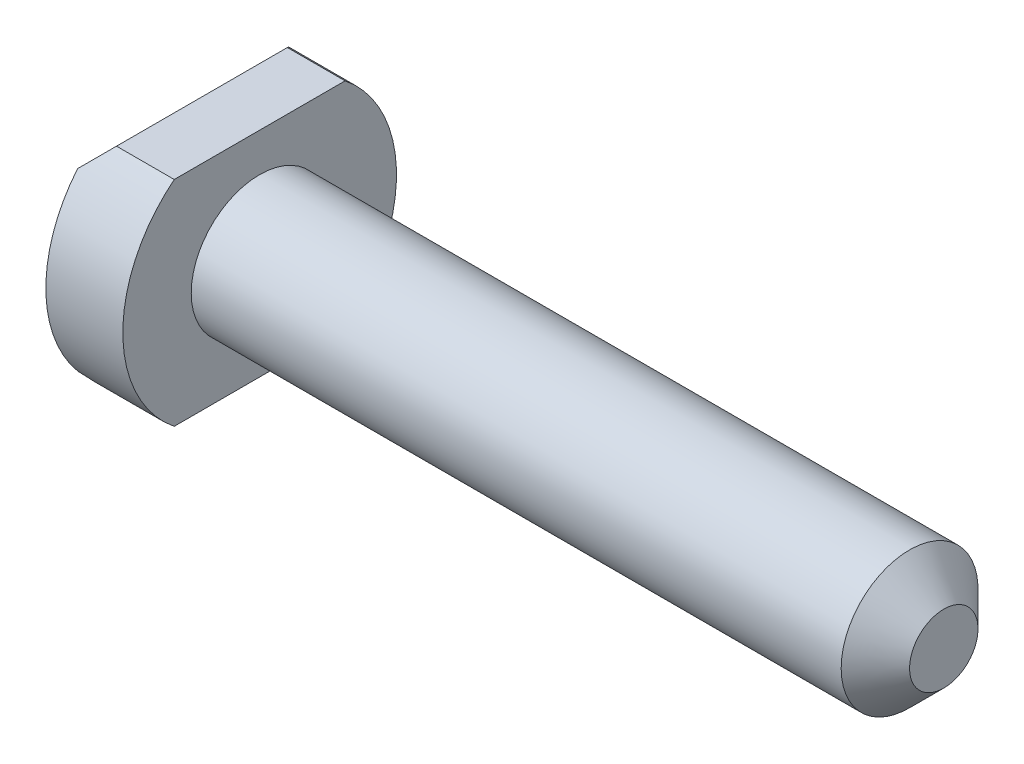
from build123d import *

# Parameters (mm, degrees)
BASEHEAD_DEPTH   = 9
HEADCHAMFER_SIZE = 2.25
BOLTSKE_W        = 20
BOLTSKE_H        = 8


with BuildPart() as part:
    # BaseHeadSke → BaseHead (new body)
    with BuildSketch(Plane(origin=(0, 0, 0), x_dir=(0, 0, -1), z_dir=(1, 0, 0))):
        with BuildLine():
            Line((-9.987492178, 12.5), (9.987492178, 12.5))
            ThreePointArc((9.987492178, 12.5), (16, 0), (9.987492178, -12.5))
            Line((9.987492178, -12.5), (-9.987492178, -12.5))
            ThreePointArc((-9.987492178, -12.5), (-16, 0), (-9.987492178, 12.5))
        make_face()
    extrude(amount=BASEHEAD_DEPTH)

    # HeadChamfer
    headchamfer_edges = [part.edges().sort_by_distance(p)[0] for p in [
        (0, 12.5, 0),
        (0, -12.5, 0),
    ]]
    chamfer(headchamfer_edges, length=HEADCHAMFER_SIZE)

    # BodySke → BaseBody (revolve)
    with BuildSketch(Plane.XY, mode=Mode.PRIVATE) as basebody_sk:
        Polygon((85, 8), (89, 4), (89, 0), (0, 0), (0, 8), align=None)
    revolve(basebody_sk.sketch.rotate(Axis((0, 0, 0), (1, 0, 0)), 90), axis=Axis((0, 0, 0), (1, 0, 0)))

    # BoltSke → Bolt (revolve)
    with BuildSketch(Plane.XY):
        with Locations((19, 4)):
            Rectangle(BOLTSKE_W, BOLTSKE_H)
    revolve(axis=Axis((0, 0, 0), (1, 0, 0)))


solid = part.part
